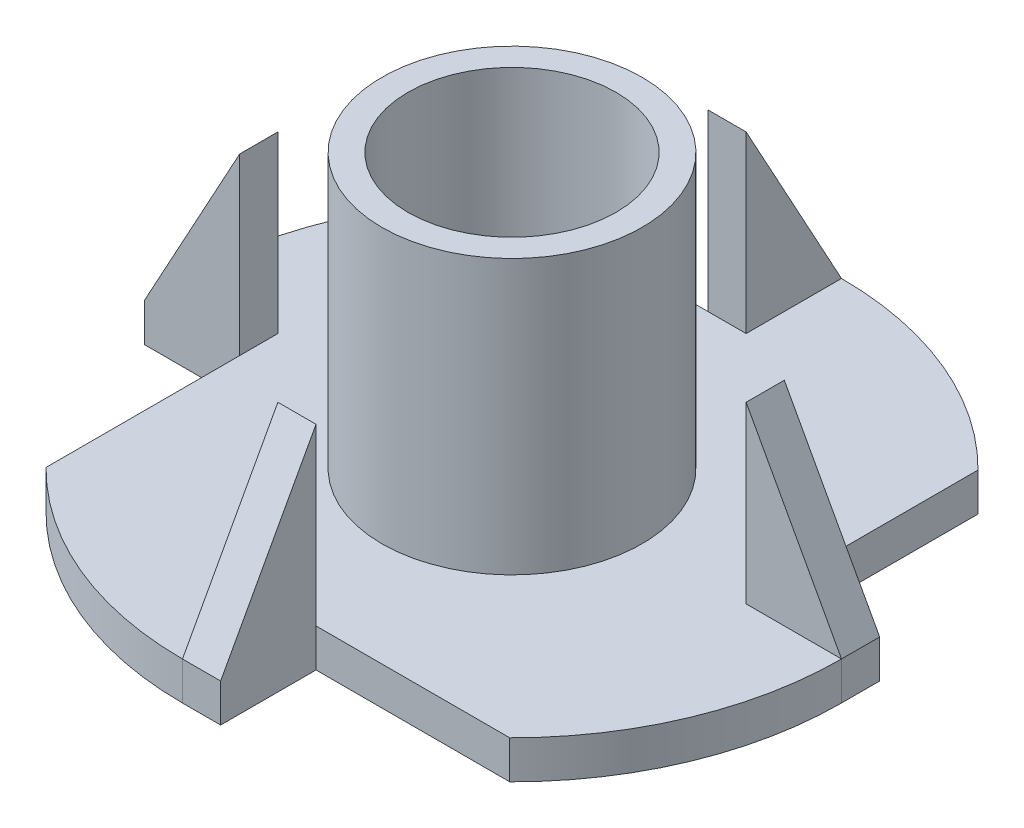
from build123d import *

# Parameters (mm, degrees)
ESQUISSE2_W                  = 6.684870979
ESQUISSE2_H                  = 2.75
ESQUISSE2_W_2                = 2.75
ESQUISSE2_H_2                = 6.684870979
ENL_V_MAT_EXTRU_1_DEPTH      = 17.170961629
BOSS_EXTRU_1_DEPTH           = 1.1
R_P_TITION_CIRCULAIRE1_COUNT = 4


with BuildPart() as part:
    # Esquisse1 → R_volution1 (revolve)
    with BuildSketch(Plane.XY, mode=Mode.PRIVATE) as r_volution1_sk:
        Polygon((-3, 0), (-3, 9), (-3.75, 9), (-3.75, 1.1), (-9.5, 1.1), (-9.5, 0), align=None)
    revolve(r_volution1_sk.sketch.rotate(Axis((0, 0, 0), (0, 1, 0)), 270), axis=Axis((0, 0, 0), (0, 1, 0)))

    # Esquisse2 → Enl_v. mat.-Extru.1 (cut, through all)
    with BuildSketch(Plane.XZ):
        with Locations((3.34243549, 8.125)):
            Rectangle(ESQUISSE2_W, ESQUISSE2_H)
        with Locations((8.125, -3.34243549)):
            Rectangle(ESQUISSE2_W_2, ESQUISSE2_H_2)
        with Locations((-3.34243549, -8.125)):
            Rectangle(ESQUISSE2_W, ESQUISSE2_H)
        with Locations((-8.125, 3.34243549)):
            Rectangle(ESQUISSE2_W_2, ESQUISSE2_H_2)
    extrude(amount=-ENL_V_MAT_EXTRU_1_DEPTH, mode=Mode.SUBTRACT)

    # Esquisse3 → Boss.-Extru.1 (add)
    with BuildSketch(Plane(origin=(0, 0, 0), x_dir=(0, 0, -1), z_dir=(1, 0, 0))):
        Polygon((-9.5, 0), (-6.75, 0), (-6.75, 6.134870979), (-9.5, 1.1), align=None)
    boss_extru_1 = extrude(amount=BOSS_EXTRU_1_DEPTH)

    # R_p_tition circulaire1: Boss.-Extru.1 ×4 about axis
    r_p_tition_circulaire1_axis = Axis((0, 0, 0), (0, 1, 0))
    for i in range(1, R_P_TITION_CIRCULAIRE1_COUNT):
        add(boss_extru_1.rotate(r_p_tition_circulaire1_axis, i * 360 / R_P_TITION_CIRCULAIRE1_COUNT))


solid = part.part
